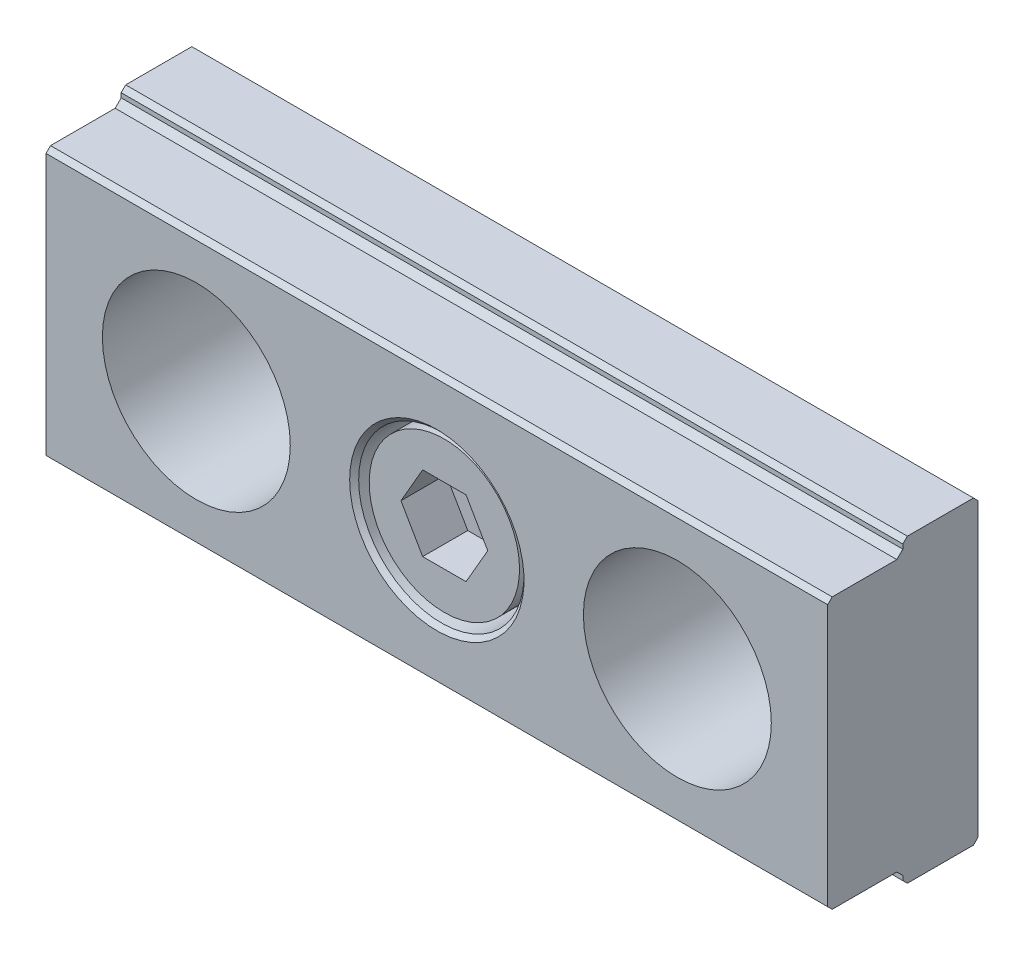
ISO-10303-21;
HEADER;
FILE_DESCRIPTION(('STEP AP214'),'2;1');
FILE_NAME('part.step','',(''),(''),'','','');
FILE_SCHEMA(('AUTOMOTIVE_DESIGN { 1 0 10303 214 1 1 1 1 }'));
ENDSEC;
DATA;
#1=APPLICATION_CONTEXT('core data for automotive mechanical design processes');
#2=APPLICATION_PROTOCOL_DEFINITION('international standard','automotive_design',2000,#1);
#3=PRODUCT_CONTEXT('',#1,'mechanical');
#4=PRODUCT('Part','Part','',(#3));
#5=PRODUCT_RELATED_PRODUCT_CATEGORY('part','',(#4));
#6=PRODUCT_DEFINITION_FORMATION('','',#4);
#7=PRODUCT_DEFINITION_CONTEXT('part definition',#1,'design');
#8=PRODUCT_DEFINITION('design','',#6,#7);
#9=PRODUCT_DEFINITION_SHAPE('','',#8);
#10=(LENGTH_UNIT() NAMED_UNIT(*) SI_UNIT(.MILLI.,.METRE.));
#11=(NAMED_UNIT(*) PLANE_ANGLE_UNIT() SI_UNIT($,.RADIAN.));
#12=(NAMED_UNIT(*) SI_UNIT($,.STERADIAN.) SOLID_ANGLE_UNIT());
#13=UNCERTAINTY_MEASURE_WITH_UNIT(LENGTH_MEASURE(1.E-05),#10,'distance_accuracy_value','');
#14=(GEOMETRIC_REPRESENTATION_CONTEXT(3) GLOBAL_UNCERTAINTY_ASSIGNED_CONTEXT((#13)) GLOBAL_UNIT_ASSIGNED_CONTEXT((#10,
#11,#12)) REPRESENTATION_CONTEXT('',''));
#15=CARTESIAN_POINT('',(0.,0.,0.));
#16=DIRECTION('',(0.,0.,1.));
#17=DIRECTION('',(1.,0.,0.));
#18=AXIS2_PLACEMENT_3D('',#15,#16,#17);
#19=CARTESIAN_POINT('',(0.,-5.5,3.5));
#20=DIRECTION('',(0.,0.,-1.));
#21=DIRECTION('',(1.,0.,0.));
#22=AXIS2_PLACEMENT_3D('',#19,#20,#21);
#23=PLANE('',#22);
#24=CARTESIAN_POINT('',(0.,0.,3.5));
#25=DIRECTION('',(0.,0.,1.));
#26=DIRECTION('',(-1.,0.,0.));
#27=AXIS2_PLACEMENT_3D('',#24,#25,#26);
#28=CIRCLE('',#27,5.5);
#29=CARTESIAN_POINT('',(-5.5,0.,3.5));
#30=VERTEX_POINT('',#29);
#31=EDGE_CURVE('E212',#30,#30,#28,.T.);
#32=ORIENTED_EDGE('',*,*,#31,.T.);
#33=EDGE_LOOP('',(#32));
#34=FACE_BOUND('',#33,.T.);
#35=CARTESIAN_POINT('',(0.,0.,3.5));
#36=DIRECTION('',(0.,0.,1.));
#37=DIRECTION('',(0.,-1.,0.));
#38=AXIS2_PLACEMENT_3D('',#35,#36,#37);
#39=CIRCLE('',#38,5.);
#40=CARTESIAN_POINT('',(0.,-5.,3.5));
#41=VERTEX_POINT('',#40);
#42=EDGE_CURVE('E9',#41,#41,#39,.T.);
#43=ORIENTED_EDGE('',*,*,#42,.F.);
#44=EDGE_LOOP('',(#43));
#45=FACE_BOUND('',#44,.T.);
#46=ADVANCED_FACE('F14',(#34,#45),#23,.F.);
#47=CARTESIAN_POINT('',(-26.,-8.7,10.));
#48=DIRECTION('',(0.,0.707106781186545,-0.70710678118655));
#49=DIRECTION('',(0.,-0.70710678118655,-0.707106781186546));
#50=AXIS2_PLACEMENT_3D('',#47,#48,#49);
#51=PLANE('',#50);
#52=DIRECTION('',(0.,0.70710678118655,0.707106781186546));
#53=VECTOR('',#52,1.);
#54=CARTESIAN_POINT('',(26.,-8.7,10.));
#55=LINE('',#54,#53);
#56=CARTESIAN_POINT('',(26.,-9.,9.7));
#57=VERTEX_POINT('',#56);
#58=CARTESIAN_POINT('',(26.,-8.7,10.));
#59=VERTEX_POINT('',#58);
#60=EDGE_CURVE('E224',#57,#59,#55,.T.);
#61=ORIENTED_EDGE('',*,*,#60,.T.);
#62=DIRECTION('',(1.,0.,0.));
#63=VECTOR('',#62,1.);
#64=CARTESIAN_POINT('',(-26.,-8.7,10.));
#65=LINE('',#64,#63);
#66=CARTESIAN_POINT('',(-26.,-8.7,10.));
#67=VERTEX_POINT('',#66);
#68=EDGE_CURVE('E24',#67,#59,#65,.T.);
#69=ORIENTED_EDGE('',*,*,#68,.F.);
#70=DIRECTION('',(0.,0.70710678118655,0.707106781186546));
#71=VECTOR('',#70,1.);
#72=CARTESIAN_POINT('',(-26.,-8.7,10.));
#73=LINE('',#72,#71);
#74=CARTESIAN_POINT('',(-26.,-9.,9.7));
#75=VERTEX_POINT('',#74);
#76=EDGE_CURVE('E225',#75,#67,#73,.T.);
#77=ORIENTED_EDGE('',*,*,#76,.F.);
#78=DIRECTION('',(1.,0.,0.));
#79=VECTOR('',#78,1.);
#80=CARTESIAN_POINT('',(-26.,-9.,9.7));
#81=LINE('',#80,#79);
#82=EDGE_CURVE('E270',#75,#57,#81,.T.);
#83=ORIENTED_EDGE('',*,*,#82,.T.);
#84=EDGE_LOOP('',(#61,#69,#77,#83));
#85=FACE_BOUND('',#84,.T.);
#86=ADVANCED_FACE('F356',(#85),#51,.F.);
#87=CARTESIAN_POINT('',(-26.,8.7,10.));
#88=DIRECTION('',(0.,0.,-1.));
#89=DIRECTION('',(1.,0.,0.));
#90=AXIS2_PLACEMENT_3D('',#87,#88,#89);
#91=PLANE('',#90);
#92=CARTESIAN_POINT('',(-16.,0.,10.));
#93=DIRECTION('',(0.,0.,1.));
#94=DIRECTION('',(-1.,0.,0.));
#95=AXIS2_PLACEMENT_3D('',#92,#93,#94);
#96=CIRCLE('',#95,6.25);
#97=CARTESIAN_POINT('',(-22.25,0.,10.));
#98=VERTEX_POINT('',#97);
#99=EDGE_CURVE('E189',#98,#98,#96,.T.);
#100=ORIENTED_EDGE('',*,*,#99,.F.);
#101=EDGE_LOOP('',(#100));
#102=FACE_BOUND('',#101,.T.);
#103=CARTESIAN_POINT('',(16.,0.,10.));
#104=DIRECTION('',(0.,0.,1.));
#105=DIRECTION('',(-1.,0.,0.));
#106=AXIS2_PLACEMENT_3D('',#103,#104,#105);
#107=CIRCLE('',#106,6.25);
#108=CARTESIAN_POINT('',(9.75,0.,10.));
#109=VERTEX_POINT('',#108);
#110=EDGE_CURVE('E198',#109,#109,#107,.T.);
#111=ORIENTED_EDGE('',*,*,#110,.F.);
#112=EDGE_LOOP('',(#111));
#113=FACE_BOUND('',#112,.T.);
#114=CARTESIAN_POINT('',(0.,0.,10.));
#115=DIRECTION('',(0.,0.,1.));
#116=DIRECTION('',(-1.,0.,0.));
#117=AXIS2_PLACEMENT_3D('',#114,#115,#116);
#118=CIRCLE('',#117,5.8);
#119=CARTESIAN_POINT('',(-5.8,0.,10.));
#120=VERTEX_POINT('',#119);
#121=EDGE_CURVE('E204',#120,#120,#118,.T.);
#122=ORIENTED_EDGE('',*,*,#121,.F.);
#123=EDGE_LOOP('',(#122));
#124=FACE_BOUND('',#123,.T.);
#125=DIRECTION('',(0.,1.,0.));
#126=VECTOR('',#125,1.);
#127=CARTESIAN_POINT('',(26.,8.7,10.));
#128=LINE('',#127,#126);
#129=CARTESIAN_POINT('',(26.,8.7,10.));
#130=VERTEX_POINT('',#129);
#131=EDGE_CURVE('E273',#59,#130,#128,.T.);
#132=ORIENTED_EDGE('',*,*,#131,.T.);
#133=DIRECTION('',(1.,0.,0.));
#134=VECTOR('',#133,1.);
#135=CARTESIAN_POINT('',(-26.,8.7,10.));
#136=LINE('',#135,#134);
#137=CARTESIAN_POINT('',(-26.,8.7,10.));
#138=VERTEX_POINT('',#137);
#139=EDGE_CURVE('E342',#138,#130,#136,.T.);
#140=ORIENTED_EDGE('',*,*,#139,.F.);
#141=DIRECTION('',(0.,1.,0.));
#142=VECTOR('',#141,1.);
#143=CARTESIAN_POINT('',(-26.,8.7,10.));
#144=LINE('',#143,#142);
#145=EDGE_CURVE('E227',#67,#138,#144,.T.);
#146=ORIENTED_EDGE('',*,*,#145,.F.);
#147=ORIENTED_EDGE('',*,*,#68,.T.);
#148=EDGE_LOOP('',(#132,#140,#146,#147));
#149=FACE_BOUND('',#148,.T.);
#150=ADVANCED_FACE('F352',(#102,#113,#124,#149),#91,.F.);
#151=CARTESIAN_POINT('',(-26.,9.,9.7));
#152=DIRECTION('',(0.,-0.707106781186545,-0.70710678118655));
#153=DIRECTION('',(0.,-0.70710678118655,0.707106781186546));
#154=AXIS2_PLACEMENT_3D('',#151,#152,#153);
#155=PLANE('',#154);
#156=DIRECTION('',(0.,0.70710678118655,-0.707106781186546));
#157=VECTOR('',#156,1.);
#158=CARTESIAN_POINT('',(26.,9.,9.7));
#159=LINE('',#158,#157);
#160=CARTESIAN_POINT('',(26.,9.,9.7));
#161=VERTEX_POINT('',#160);
#162=EDGE_CURVE('E275',#130,#161,#159,.T.);
#163=ORIENTED_EDGE('',*,*,#162,.T.);
#164=DIRECTION('',(1.,0.,0.));
#165=VECTOR('',#164,1.);
#166=CARTESIAN_POINT('',(-26.,9.,9.7));
#167=LINE('',#166,#165);
#168=CARTESIAN_POINT('',(-26.,9.,9.7));
#169=VERTEX_POINT('',#168);
#170=EDGE_CURVE('E340',#169,#161,#167,.T.);
#171=ORIENTED_EDGE('',*,*,#170,.F.);
#172=DIRECTION('',(0.,0.70710678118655,-0.707106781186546));
#173=VECTOR('',#172,1.);
#174=CARTESIAN_POINT('',(-26.,9.,9.7));
#175=LINE('',#174,#173);
#176=EDGE_CURVE('E231',#138,#169,#175,.T.);
#177=ORIENTED_EDGE('',*,*,#176,.F.);
#178=ORIENTED_EDGE('',*,*,#139,.T.);
#179=EDGE_LOOP('',(#163,#171,#177,#178));
#180=FACE_BOUND('',#179,.T.);
#181=ADVANCED_FACE('F364',(#180),#155,.F.);
#182=CARTESIAN_POINT('',(-26.,9.,5.4));
#183=DIRECTION('',(0.,-1.,0.));
#184=DIRECTION('',(1.,0.,0.));
#185=AXIS2_PLACEMENT_3D('',#182,#183,#184);
#186=PLANE('',#185);
#187=DIRECTION('',(0.,0.,-1.));
#188=VECTOR('',#187,1.);
#189=CARTESIAN_POINT('',(26.,9.,5.4));
#190=LINE('',#189,#188);
#191=CARTESIAN_POINT('',(26.,9.,5.4));
#192=VERTEX_POINT('',#191);
#193=EDGE_CURVE('E277',#161,#192,#190,.T.);
#194=ORIENTED_EDGE('',*,*,#193,.T.);
#195=DIRECTION('',(1.,0.,0.));
#196=VECTOR('',#195,1.);
#197=CARTESIAN_POINT('',(-26.,9.,5.4));
#198=LINE('',#197,#196);
#199=CARTESIAN_POINT('',(-26.,9.,5.4));
#200=VERTEX_POINT('',#199);
#201=EDGE_CURVE('E337',#200,#192,#198,.T.);
#202=ORIENTED_EDGE('',*,*,#201,.F.);
#203=DIRECTION('',(0.,0.,-1.));
#204=VECTOR('',#203,1.);
#205=CARTESIAN_POINT('',(-26.,9.,5.4));
#206=LINE('',#205,#204);
#207=EDGE_CURVE('E234',#169,#200,#206,.T.);
#208=ORIENTED_EDGE('',*,*,#207,.F.);
#209=ORIENTED_EDGE('',*,*,#170,.T.);
#210=EDGE_LOOP('',(#194,#202,#208,#209));
#211=FACE_BOUND('',#210,.T.);
#212=ADVANCED_FACE('F368',(#211),#186,.F.);
#213=CARTESIAN_POINT('',(-26.,9.4,5.));
#214=DIRECTION('',(0.,-0.707106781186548,-0.707106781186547));
#215=DIRECTION('',(0.,-0.707106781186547,0.707106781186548));
#216=AXIS2_PLACEMENT_3D('',#213,#214,#215);
#217=PLANE('',#216);
#218=DIRECTION('',(0.,0.707106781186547,-0.707106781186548));
#219=VECTOR('',#218,1.);
#220=CARTESIAN_POINT('',(26.,9.4,5.));
#221=LINE('',#220,#219);
#222=CARTESIAN_POINT('',(26.,9.4,5.));
#223=VERTEX_POINT('',#222);
#224=EDGE_CURVE('E279',#192,#223,#221,.T.);
#225=ORIENTED_EDGE('',*,*,#224,.T.);
#226=DIRECTION('',(1.,0.,0.));
#227=VECTOR('',#226,1.);
#228=CARTESIAN_POINT('',(-26.,9.4,5.));
#229=LINE('',#228,#227);
#230=CARTESIAN_POINT('',(-26.,9.4,5.));
#231=VERTEX_POINT('',#230);
#232=EDGE_CURVE('E334',#231,#223,#229,.T.);
#233=ORIENTED_EDGE('',*,*,#232,.F.);
#234=DIRECTION('',(0.,0.707106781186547,-0.707106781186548));
#235=VECTOR('',#234,1.);
#236=CARTESIAN_POINT('',(-26.,9.4,5.));
#237=LINE('',#236,#235);
#238=EDGE_CURVE('E237',#200,#231,#237,.T.);
#239=ORIENTED_EDGE('',*,*,#238,.F.);
#240=ORIENTED_EDGE('',*,*,#201,.T.);
#241=EDGE_LOOP('',(#225,#233,#239,#240));
#242=FACE_BOUND('',#241,.T.);
#243=ADVANCED_FACE('F683',(#242),#217,.F.);
#244=CARTESIAN_POINT('',(-26.,9.7,5.));
#245=DIRECTION('',(0.,0.,-1.));
#246=DIRECTION('',(1.,0.,0.));
#247=AXIS2_PLACEMENT_3D('',#244,#245,#246);
#248=PLANE('',#247);
#249=DIRECTION('',(0.,1.,0.));
#250=VECTOR('',#249,1.);
#251=CARTESIAN_POINT('',(26.,9.7,5.));
#252=LINE('',#251,#250);
#253=CARTESIAN_POINT('',(26.,9.7,5.));
#254=VERTEX_POINT('',#253);
#255=EDGE_CURVE('E281',#223,#254,#252,.T.);
#256=ORIENTED_EDGE('',*,*,#255,.T.);
#257=DIRECTION('',(1.,0.,0.));
#258=VECTOR('',#257,1.);
#259=CARTESIAN_POINT('',(-26.,9.7,5.));
#260=LINE('',#259,#258);
#261=CARTESIAN_POINT('',(-26.,9.7,5.));
#262=VERTEX_POINT('',#261);
#263=EDGE_CURVE('E331',#262,#254,#260,.T.);
#264=ORIENTED_EDGE('',*,*,#263,.F.);
#265=DIRECTION('',(0.,1.,0.));
#266=VECTOR('',#265,1.);
#267=CARTESIAN_POINT('',(-26.,9.7,5.));
#268=LINE('',#267,#266);
#269=EDGE_CURVE('E240',#231,#262,#268,.T.);
#270=ORIENTED_EDGE('',*,*,#269,.F.);
#271=ORIENTED_EDGE('',*,*,#232,.T.);
#272=EDGE_LOOP('',(#256,#264,#270,#271));
#273=FACE_BOUND('',#272,.T.);
#274=ADVANCED_FACE('F674',(#273),#248,.F.);
#275=CARTESIAN_POINT('',(-26.,10.,4.7));
#276=DIRECTION('',(0.,-0.707106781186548,-0.707106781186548));
#277=DIRECTION('',(0.,-0.707106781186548,0.707106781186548));
#278=AXIS2_PLACEMENT_3D('',#275,#276,#277);
#279=PLANE('',#278);
#280=DIRECTION('',(0.,0.707106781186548,-0.707106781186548));
#281=VECTOR('',#280,1.);
#282=CARTESIAN_POINT('',(26.,10.,4.7));
#283=LINE('',#282,#281);
#284=CARTESIAN_POINT('',(26.,10.,4.7));
#285=VERTEX_POINT('',#284);
#286=EDGE_CURVE('E283',#254,#285,#283,.T.);
#287=ORIENTED_EDGE('',*,*,#286,.T.);
#288=DIRECTION('',(1.,0.,0.));
#289=VECTOR('',#288,1.);
#290=CARTESIAN_POINT('',(-26.,10.,4.7));
#291=LINE('',#290,#289);
#292=CARTESIAN_POINT('',(-26.,10.,4.7));
#293=VERTEX_POINT('',#292);
#294=EDGE_CURVE('E328',#293,#285,#291,.T.);
#295=ORIENTED_EDGE('',*,*,#294,.F.);
#296=DIRECTION('',(0.,0.707106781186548,-0.707106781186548));
#297=VECTOR('',#296,1.);
#298=CARTESIAN_POINT('',(-26.,10.,4.7));
#299=LINE('',#298,#297);
#300=EDGE_CURVE('E243',#262,#293,#299,.T.);
#301=ORIENTED_EDGE('',*,*,#300,.F.);
#302=ORIENTED_EDGE('',*,*,#263,.T.);
#303=EDGE_LOOP('',(#287,#295,#301,#302));
#304=FACE_BOUND('',#303,.T.);
#305=ADVANCED_FACE('F665',(#304),#279,.F.);
#306=CARTESIAN_POINT('',(-26.,10.,0.3));
#307=DIRECTION('',(0.,-1.,0.));
#308=DIRECTION('',(0.,0.,1.));
#309=AXIS2_PLACEMENT_3D('',#306,#307,#308);
#310=PLANE('',#309);
#311=DIRECTION('',(0.,0.,-1.));
#312=VECTOR('',#311,1.);
#313=CARTESIAN_POINT('',(26.,10.,0.3));
#314=LINE('',#313,#312);
#315=CARTESIAN_POINT('',(26.,10.,0.3));
#316=VERTEX_POINT('',#315);
#317=EDGE_CURVE('E285',#285,#316,#314,.T.);
#318=ORIENTED_EDGE('',*,*,#317,.T.);
#319=DIRECTION('',(1.,0.,0.));
#320=VECTOR('',#319,1.);
#321=CARTESIAN_POINT('',(-26.,10.,0.3));
#322=LINE('',#321,#320);
#323=CARTESIAN_POINT('',(-26.,10.,0.3));
#324=VERTEX_POINT('',#323);
#325=EDGE_CURVE('E325',#324,#316,#322,.T.);
#326=ORIENTED_EDGE('',*,*,#325,.F.);
#327=DIRECTION('',(0.,0.,-1.));
#328=VECTOR('',#327,1.);
#329=CARTESIAN_POINT('',(-26.,10.,0.3));
#330=LINE('',#329,#328);
#331=EDGE_CURVE('E246',#293,#324,#330,.T.);
#332=ORIENTED_EDGE('',*,*,#331,.F.);
#333=ORIENTED_EDGE('',*,*,#294,.T.);
#334=EDGE_LOOP('',(#318,#326,#332,#333));
#335=FACE_BOUND('',#334,.T.);
#336=ADVANCED_FACE('F656',(#335),#310,.F.);
#337=CARTESIAN_POINT('',(-26.,10.,0.3));
#338=DIRECTION('',(0.,-0.70710678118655,0.707106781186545));
#339=DIRECTION('',(0.,0.707106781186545,0.70710678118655));
#340=AXIS2_PLACEMENT_3D('',#337,#338,#339);
#341=PLANE('',#340);
#342=DIRECTION('',(0.,-0.707106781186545,-0.70710678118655));
#343=VECTOR('',#342,1.);
#344=CARTESIAN_POINT('',(26.,10.,0.3));
#345=LINE('',#344,#343);
#346=CARTESIAN_POINT('',(26.,9.7,0.));
#347=VERTEX_POINT('',#346);
#348=EDGE_CURVE('E287',#316,#347,#345,.T.);
#349=ORIENTED_EDGE('',*,*,#348,.T.);
#350=DIRECTION('',(1.,0.,0.));
#351=VECTOR('',#350,1.);
#352=CARTESIAN_POINT('',(-26.,9.7,0.));
#353=LINE('',#352,#351);
#354=CARTESIAN_POINT('',(-26.,9.7,0.));
#355=VERTEX_POINT('',#354);
#356=EDGE_CURVE('E322',#355,#347,#353,.T.);
#357=ORIENTED_EDGE('',*,*,#356,.F.);
#358=DIRECTION('',(0.,-0.707106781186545,-0.70710678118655));
#359=VECTOR('',#358,1.);
#360=CARTESIAN_POINT('',(-26.,10.,0.3));
#361=LINE('',#360,#359);
#362=EDGE_CURVE('E249',#324,#355,#361,.T.);
#363=ORIENTED_EDGE('',*,*,#362,.F.);
#364=ORIENTED_EDGE('',*,*,#325,.T.);
#365=EDGE_LOOP('',(#349,#357,#363,#364));
#366=FACE_BOUND('',#365,.T.);
#367=ADVANCED_FACE('F647',(#366),#341,.F.);
#368=CARTESIAN_POINT('',(-26.,9.7,0.));
#369=DIRECTION('',(0.,0.,1.));
#370=DIRECTION('',(-1.,0.,0.));
#371=AXIS2_PLACEMENT_3D('',#368,#369,#370);
#372=PLANE('',#371);
#373=CARTESIAN_POINT('',(-16.,0.,0.));
#374=DIRECTION('',(0.,0.,1.));
#375=DIRECTION('',(-1.,0.,0.));
#376=AXIS2_PLACEMENT_3D('',#373,#374,#375);
#377=CIRCLE('',#376,6.25);
#378=CARTESIAN_POINT('',(-22.25,0.,0.));
#379=VERTEX_POINT('',#378);
#380=EDGE_CURVE('E193',#379,#379,#377,.T.);
#381=ORIENTED_EDGE('',*,*,#380,.T.);
#382=EDGE_LOOP('',(#381));
#383=FACE_BOUND('',#382,.T.);
#384=CARTESIAN_POINT('',(16.,0.,0.));
#385=DIRECTION('',(0.,0.,1.));
#386=DIRECTION('',(-1.,0.,0.));
#387=AXIS2_PLACEMENT_3D('',#384,#385,#386);
#388=CIRCLE('',#387,6.25);
#389=CARTESIAN_POINT('',(9.75,0.,0.));
#390=VERTEX_POINT('',#389);
#391=EDGE_CURVE('E201',#390,#390,#388,.T.);
#392=ORIENTED_EDGE('',*,*,#391,.T.);
#393=EDGE_LOOP('',(#392));
#394=FACE_BOUND('',#393,.T.);
#395=CARTESIAN_POINT('',(0.,0.,0.));
#396=DIRECTION('',(0.,0.,1.));
#397=DIRECTION('',(-1.,0.,0.));
#398=AXIS2_PLACEMENT_3D('',#395,#396,#397);
#399=CIRCLE('',#398,3.6);
#400=CARTESIAN_POINT('',(-3.6,0.,0.));
#401=VERTEX_POINT('',#400);
#402=EDGE_CURVE('E221',#401,#401,#399,.T.);
#403=ORIENTED_EDGE('',*,*,#402,.T.);
#404=EDGE_LOOP('',(#403));
#405=FACE_BOUND('',#404,.T.);
#406=DIRECTION('',(0.,-1.,0.));
#407=VECTOR('',#406,1.);
#408=CARTESIAN_POINT('',(26.,9.7,0.));
#409=LINE('',#408,#407);
#410=CARTESIAN_POINT('',(26.,-9.7,0.));
#411=VERTEX_POINT('',#410);
#412=EDGE_CURVE('E289',#347,#411,#409,.T.);
#413=ORIENTED_EDGE('',*,*,#412,.T.);
#414=DIRECTION('',(1.,0.,0.));
#415=VECTOR('',#414,1.);
#416=CARTESIAN_POINT('',(-26.,-9.7,0.));
#417=LINE('',#416,#415);
#418=CARTESIAN_POINT('',(-26.,-9.7,0.));
#419=VERTEX_POINT('',#418);
#420=EDGE_CURVE('E319',#419,#411,#417,.T.);
#421=ORIENTED_EDGE('',*,*,#420,.F.);
#422=DIRECTION('',(0.,-1.,0.));
#423=VECTOR('',#422,1.);
#424=CARTESIAN_POINT('',(-26.,9.7,0.));
#425=LINE('',#424,#423);
#426=EDGE_CURVE('E252',#355,#419,#425,.T.);
#427=ORIENTED_EDGE('',*,*,#426,.F.);
#428=ORIENTED_EDGE('',*,*,#356,.T.);
#429=EDGE_LOOP('',(#413,#421,#427,#428));
#430=FACE_BOUND('',#429,.T.);
#431=ADVANCED_FACE('F638',(#383,#394,#405,#430),#372,.F.);
#432=CARTESIAN_POINT('',(-26.,-9.7,0.));
#433=DIRECTION('',(0.,0.70710678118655,0.707106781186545));
#434=DIRECTION('',(0.,0.707106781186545,-0.70710678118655));
#435=AXIS2_PLACEMENT_3D('',#432,#433,#434);
#436=PLANE('',#435);
#437=DIRECTION('',(0.,-0.707106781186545,0.70710678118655));
#438=VECTOR('',#437,1.);
#439=CARTESIAN_POINT('',(26.,-9.7,0.));
#440=LINE('',#439,#438);
#441=CARTESIAN_POINT('',(26.,-10.,0.3));
#442=VERTEX_POINT('',#441);
#443=EDGE_CURVE('E291',#411,#442,#440,.T.);
#444=ORIENTED_EDGE('',*,*,#443,.T.);
#445=DIRECTION('',(1.,0.,0.));
#446=VECTOR('',#445,1.);
#447=CARTESIAN_POINT('',(-26.,-10.,0.3));
#448=LINE('',#447,#446);
#449=CARTESIAN_POINT('',(-26.,-10.,0.3));
#450=VERTEX_POINT('',#449);
#451=EDGE_CURVE('E316',#450,#442,#448,.T.);
#452=ORIENTED_EDGE('',*,*,#451,.F.);
#453=DIRECTION('',(0.,-0.707106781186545,0.70710678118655));
#454=VECTOR('',#453,1.);
#455=CARTESIAN_POINT('',(-26.,-9.7,0.));
#456=LINE('',#455,#454);
#457=EDGE_CURVE('E255',#419,#450,#456,.T.);
#458=ORIENTED_EDGE('',*,*,#457,.F.);
#459=ORIENTED_EDGE('',*,*,#420,.T.);
#460=EDGE_LOOP('',(#444,#452,#458,#459));
#461=FACE_BOUND('',#460,.T.);
#462=ADVANCED_FACE('F629',(#461),#436,.F.);
#463=CARTESIAN_POINT('',(-26.,-10.,0.3));
#464=DIRECTION('',(0.,1.,0.));
#465=DIRECTION('',(0.,0.,-1.));
#466=AXIS2_PLACEMENT_3D('',#463,#464,#465);
#467=PLANE('',#466);
#468=DIRECTION('',(0.,0.,1.));
#469=VECTOR('',#468,1.);
#470=CARTESIAN_POINT('',(26.,-10.,0.3));
#471=LINE('',#470,#469);
#472=CARTESIAN_POINT('',(26.,-10.,4.7));
#473=VERTEX_POINT('',#472);
#474=EDGE_CURVE('E293',#442,#473,#471,.T.);
#475=ORIENTED_EDGE('',*,*,#474,.T.);
#476=DIRECTION('',(1.,0.,0.));
#477=VECTOR('',#476,1.);
#478=CARTESIAN_POINT('',(-26.,-10.,4.7));
#479=LINE('',#478,#477);
#480=CARTESIAN_POINT('',(-26.,-10.,4.7));
#481=VERTEX_POINT('',#480);
#482=EDGE_CURVE('E313',#481,#473,#479,.T.);
#483=ORIENTED_EDGE('',*,*,#482,.F.);
#484=DIRECTION('',(0.,0.,1.));
#485=VECTOR('',#484,1.);
#486=CARTESIAN_POINT('',(-26.,-10.,0.3));
#487=LINE('',#486,#485);
#488=EDGE_CURVE('E258',#450,#481,#487,.T.);
#489=ORIENTED_EDGE('',*,*,#488,.F.);
#490=ORIENTED_EDGE('',*,*,#451,.T.);
#491=EDGE_LOOP('',(#475,#483,#489,#490));
#492=FACE_BOUND('',#491,.T.);
#493=ADVANCED_FACE('F620',(#492),#467,.F.);
#494=CARTESIAN_POINT('',(-26.,-9.7,5.));
#495=DIRECTION('',(0.,0.707106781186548,-0.707106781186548));
#496=DIRECTION('',(0.,-0.707106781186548,-0.707106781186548));
#497=AXIS2_PLACEMENT_3D('',#494,#495,#496);
#498=PLANE('',#497);
#499=DIRECTION('',(0.,0.707106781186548,0.707106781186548));
#500=VECTOR('',#499,1.);
#501=CARTESIAN_POINT('',(26.,-9.7,5.));
#502=LINE('',#501,#500);
#503=CARTESIAN_POINT('',(26.,-9.7,5.));
#504=VERTEX_POINT('',#503);
#505=EDGE_CURVE('E295',#473,#504,#502,.T.);
#506=ORIENTED_EDGE('',*,*,#505,.T.);
#507=DIRECTION('',(1.,0.,0.));
#508=VECTOR('',#507,1.);
#509=CARTESIAN_POINT('',(-26.,-9.7,5.));
#510=LINE('',#509,#508);
#511=CARTESIAN_POINT('',(-26.,-9.7,5.));
#512=VERTEX_POINT('',#511);
#513=EDGE_CURVE('E310',#512,#504,#510,.T.);
#514=ORIENTED_EDGE('',*,*,#513,.F.);
#515=DIRECTION('',(0.,0.707106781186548,0.707106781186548));
#516=VECTOR('',#515,1.);
#517=CARTESIAN_POINT('',(-26.,-9.7,5.));
#518=LINE('',#517,#516);
#519=EDGE_CURVE('E261',#481,#512,#518,.T.);
#520=ORIENTED_EDGE('',*,*,#519,.F.);
#521=ORIENTED_EDGE('',*,*,#482,.T.);
#522=EDGE_LOOP('',(#506,#514,#520,#521));
#523=FACE_BOUND('',#522,.T.);
#524=ADVANCED_FACE('F613',(#523),#498,.F.);
#525=CARTESIAN_POINT('',(-26.,-9.4,5.));
#526=DIRECTION('',(0.,0.,-1.));
#527=DIRECTION('',(1.,0.,0.));
#528=AXIS2_PLACEMENT_3D('',#525,#526,#527);
#529=PLANE('',#528);
#530=DIRECTION('',(0.,1.,0.));
#531=VECTOR('',#530,1.);
#532=CARTESIAN_POINT('',(26.,-9.4,5.));
#533=LINE('',#532,#531);
#534=CARTESIAN_POINT('',(26.,-9.4,5.));
#535=VERTEX_POINT('',#534);
#536=EDGE_CURVE('E297',#504,#535,#533,.T.);
#537=ORIENTED_EDGE('',*,*,#536,.T.);
#538=DIRECTION('',(1.,0.,0.));
#539=VECTOR('',#538,1.);
#540=CARTESIAN_POINT('',(-26.,-9.4,5.));
#541=LINE('',#540,#539);
#542=CARTESIAN_POINT('',(-26.,-9.4,5.));
#543=VERTEX_POINT('',#542);
#544=EDGE_CURVE('E307',#543,#535,#541,.T.);
#545=ORIENTED_EDGE('',*,*,#544,.F.);
#546=DIRECTION('',(0.,1.,0.));
#547=VECTOR('',#546,1.);
#548=CARTESIAN_POINT('',(-26.,-9.4,5.));
#549=LINE('',#548,#547);
#550=EDGE_CURVE('E264',#512,#543,#549,.T.);
#551=ORIENTED_EDGE('',*,*,#550,.F.);
#552=ORIENTED_EDGE('',*,*,#513,.T.);
#553=EDGE_LOOP('',(#537,#545,#551,#552));
#554=FACE_BOUND('',#553,.T.);
#555=ADVANCED_FACE('F403',(#554),#529,.F.);
#556=CARTESIAN_POINT('',(-26.,-9.4,5.));
#557=DIRECTION('',(0.,0.707106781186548,-0.707106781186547));
#558=DIRECTION('',(0.,-0.707106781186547,-0.707106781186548));
#559=AXIS2_PLACEMENT_3D('',#556,#557,#558);
#560=PLANE('',#559);
#561=DIRECTION('',(0.,0.707106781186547,0.707106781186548));
#562=VECTOR('',#561,1.);
#563=CARTESIAN_POINT('',(26.,-9.4,5.));
#564=LINE('',#563,#562);
#565=CARTESIAN_POINT('',(26.,-9.,5.4));
#566=VERTEX_POINT('',#565);
#567=EDGE_CURVE('E299',#535,#566,#564,.T.);
#568=ORIENTED_EDGE('',*,*,#567,.T.);
#569=DIRECTION('',(1.,0.,0.));
#570=VECTOR('',#569,1.);
#571=CARTESIAN_POINT('',(-26.,-9.,5.4));
#572=LINE('',#571,#570);
#573=CARTESIAN_POINT('',(-26.,-9.,5.4));
#574=VERTEX_POINT('',#573);
#575=EDGE_CURVE('E304',#574,#566,#572,.T.);
#576=ORIENTED_EDGE('',*,*,#575,.F.);
#577=DIRECTION('',(0.,0.707106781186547,0.707106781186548));
#578=VECTOR('',#577,1.);
#579=CARTESIAN_POINT('',(-26.,-9.4,5.));
#580=LINE('',#579,#578);
#581=EDGE_CURVE('E267',#543,#574,#580,.T.);
#582=ORIENTED_EDGE('',*,*,#581,.F.);
#583=ORIENTED_EDGE('',*,*,#544,.T.);
#584=EDGE_LOOP('',(#568,#576,#582,#583));
#585=FACE_BOUND('',#584,.T.);
#586=ADVANCED_FACE('F406',(#585),#560,.F.);
#587=CARTESIAN_POINT('',(-26.,-9.,5.4));
#588=DIRECTION('',(0.,1.,0.));
#589=DIRECTION('',(-1.,0.,0.));
#590=AXIS2_PLACEMENT_3D('',#587,#588,#589);
#591=PLANE('',#590);
#592=DIRECTION('',(0.,0.,1.));
#593=VECTOR('',#592,1.);
#594=CARTESIAN_POINT('',(26.,-9.,5.4));
#595=LINE('',#594,#593);
#596=EDGE_CURVE('E228',#566,#57,#595,.T.);
#597=ORIENTED_EDGE('',*,*,#596,.T.);
#598=ORIENTED_EDGE('',*,*,#82,.F.);
#599=DIRECTION('',(0.,0.,1.));
#600=VECTOR('',#599,1.);
#601=CARTESIAN_POINT('',(-26.,-9.,5.4));
#602=LINE('',#601,#600);
#603=EDGE_CURVE('E32',#574,#75,#602,.T.);
#604=ORIENTED_EDGE('',*,*,#603,.F.);
#605=ORIENTED_EDGE('',*,*,#575,.T.);
#606=EDGE_LOOP('',(#597,#598,#604,#605));
#607=FACE_BOUND('',#606,.T.);
#608=ADVANCED_FACE('F408',(#607),#591,.F.);
#609=CARTESIAN_POINT('',(-26.,-14.2,4.5));
#610=DIRECTION('',(-1.,0.,0.));
#611=DIRECTION('',(0.,-1.,0.));
#612=AXIS2_PLACEMENT_3D('',#609,#610,#611);
#613=PLANE('',#612);
#614=ORIENTED_EDGE('',*,*,#76,.T.);
#615=ORIENTED_EDGE('',*,*,#145,.T.);
#616=ORIENTED_EDGE('',*,*,#176,.T.);
#617=ORIENTED_EDGE('',*,*,#207,.T.);
#618=ORIENTED_EDGE('',*,*,#238,.T.);
#619=ORIENTED_EDGE('',*,*,#269,.T.);
#620=ORIENTED_EDGE('',*,*,#300,.T.);
#621=ORIENTED_EDGE('',*,*,#331,.T.);
#622=ORIENTED_EDGE('',*,*,#362,.T.);
#623=ORIENTED_EDGE('',*,*,#426,.T.);
#624=ORIENTED_EDGE('',*,*,#457,.T.);
#625=ORIENTED_EDGE('',*,*,#488,.T.);
#626=ORIENTED_EDGE('',*,*,#519,.T.);
#627=ORIENTED_EDGE('',*,*,#550,.T.);
#628=ORIENTED_EDGE('',*,*,#581,.T.);
#629=ORIENTED_EDGE('',*,*,#603,.T.);
#630=EDGE_LOOP('',(#614,#615,#616,#617,#618,#619,#620,#621,#622,#623,#624,#625,#626,#627,#628,#629));
#631=FACE_BOUND('',#630,.T.);
#632=ADVANCED_FACE('F374',(#631),#613,.T.);
#633=CARTESIAN_POINT('',(26.,-14.2,4.5));
#634=DIRECTION('',(-1.,0.,0.));
#635=DIRECTION('',(0.,-1.,0.));
#636=AXIS2_PLACEMENT_3D('',#633,#634,#635);
#637=PLANE('',#636);
#638=ORIENTED_EDGE('',*,*,#60,.F.);
#639=ORIENTED_EDGE('',*,*,#596,.F.);
#640=ORIENTED_EDGE('',*,*,#567,.F.);
#641=ORIENTED_EDGE('',*,*,#536,.F.);
#642=ORIENTED_EDGE('',*,*,#505,.F.);
#643=ORIENTED_EDGE('',*,*,#474,.F.);
#644=ORIENTED_EDGE('',*,*,#443,.F.);
#645=ORIENTED_EDGE('',*,*,#412,.F.);
#646=ORIENTED_EDGE('',*,*,#348,.F.);
#647=ORIENTED_EDGE('',*,*,#317,.F.);
#648=ORIENTED_EDGE('',*,*,#286,.F.);
#649=ORIENTED_EDGE('',*,*,#255,.F.);
#650=ORIENTED_EDGE('',*,*,#224,.F.);
#651=ORIENTED_EDGE('',*,*,#193,.F.);
#652=ORIENTED_EDGE('',*,*,#162,.F.);
#653=ORIENTED_EDGE('',*,*,#131,.F.);
#654=EDGE_LOOP('',(#638,#639,#640,#641,#642,#643,#644,#645,#646,#647,#648,#649,#650,#651,#652,#653));
#655=FACE_BOUND('',#654,.T.);
#656=ADVANCED_FACE('F359',(#655),#637,.F.);
#657=CARTESIAN_POINT('',(0.,0.,0.3));
#658=DIRECTION('',(0.,0.,-1.));
#659=DIRECTION('',(1.,0.,0.));
#660=AXIS2_PLACEMENT_3D('',#657,#658,#659);
#661=CONICAL_SURFACE('',#660,3.3,0.78539816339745);
#662=ORIENTED_EDGE('',*,*,#402,.F.);
#663=EDGE_LOOP('',(#662));
#664=FACE_BOUND('',#663,.T.);
#665=CARTESIAN_POINT('',(0.,0.,0.3));
#666=DIRECTION('',(0.,0.,1.));
#667=DIRECTION('',(-1.,0.,0.));
#668=AXIS2_PLACEMENT_3D('',#665,#666,#667);
#669=CIRCLE('',#668,3.3);
#670=CARTESIAN_POINT('',(-3.3,0.,0.3));
#671=VERTEX_POINT('',#670);
#672=EDGE_CURVE('E218',#671,#671,#669,.T.);
#673=ORIENTED_EDGE('',*,*,#672,.T.);
#674=EDGE_LOOP('',(#673));
#675=FACE_BOUND('',#674,.T.);
#676=ADVANCED_FACE('F482',(#664,#675),#661,.F.);
#677=CARTESIAN_POINT('',(0.,0.,10.));
#678=DIRECTION('',(0.,0.,1.));
#679=DIRECTION('',(-1.,0.,0.));
#680=AXIS2_PLACEMENT_3D('',#677,#678,#679);
#681=CYLINDRICAL_SURFACE('',#680,3.3);
#682=ORIENTED_EDGE('',*,*,#672,.F.);
#683=EDGE_LOOP('',(#682));
#684=FACE_BOUND('',#683,.T.);
#685=CARTESIAN_POINT('',(0.,0.,3.5));
#686=DIRECTION('',(0.,0.,1.));
#687=DIRECTION('',(-1.,0.,0.));
#688=AXIS2_PLACEMENT_3D('',#685,#686,#687);
#689=CIRCLE('',#688,3.3);
#690=CARTESIAN_POINT('',(-3.3,0.,3.5));
#691=VERTEX_POINT('',#690);
#692=EDGE_CURVE('E215',#691,#691,#689,.T.);
#693=ORIENTED_EDGE('',*,*,#692,.T.);
#694=EDGE_LOOP('',(#693));
#695=FACE_BOUND('',#694,.T.);
#696=ADVANCED_FACE('F479',(#684,#695),#681,.F.);
#697=CARTESIAN_POINT('',(0.,0.,10.));
#698=DIRECTION('',(0.,0.,1.));
#699=DIRECTION('',(-1.,0.,0.));
#700=AXIS2_PLACEMENT_3D('',#697,#698,#699);
#701=CYLINDRICAL_SURFACE('',#700,5.5);
#702=ORIENTED_EDGE('',*,*,#31,.F.);
#703=EDGE_LOOP('',(#702));
#704=FACE_BOUND('',#703,.T.);
#705=CARTESIAN_POINT('',(0.,0.,9.7));
#706=DIRECTION('',(0.,0.,1.));
#707=DIRECTION('',(-1.,0.,0.));
#708=AXIS2_PLACEMENT_3D('',#705,#706,#707);
#709=CIRCLE('',#708,5.5);
#710=CARTESIAN_POINT('',(-5.5,0.,9.7));
#711=VERTEX_POINT('',#710);
#712=EDGE_CURVE('E209',#711,#711,#709,.T.);
#713=ORIENTED_EDGE('',*,*,#712,.T.);
#714=EDGE_LOOP('',(#713));
#715=FACE_BOUND('',#714,.T.);
#716=ADVANCED_FACE('F477',(#704,#715),#701,.F.);
#717=CARTESIAN_POINT('',(0.,0.,10.));
#718=DIRECTION('',(0.,0.,1.));
#719=DIRECTION('',(-1.,0.,0.));
#720=AXIS2_PLACEMENT_3D('',#717,#718,#719);
#721=CONICAL_SURFACE('',#720,5.8,0.785398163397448);
#722=ORIENTED_EDGE('',*,*,#712,.F.);
#723=EDGE_LOOP('',(#722));
#724=FACE_BOUND('',#723,.T.);
#725=ORIENTED_EDGE('',*,*,#121,.T.);
#726=EDGE_LOOP('',(#725));
#727=FACE_BOUND('',#726,.T.);
#728=ADVANCED_FACE('F514',(#724,#727),#721,.F.);
#729=CARTESIAN_POINT('',(16.,0.,0.));
#730=DIRECTION('',(0.,0.,1.));
#731=DIRECTION('',(-1.,0.,0.));
#732=AXIS2_PLACEMENT_3D('',#729,#730,#731);
#733=CYLINDRICAL_SURFACE('',#732,6.25);
#734=ORIENTED_EDGE('',*,*,#391,.F.);
#735=EDGE_LOOP('',(#734));
#736=FACE_BOUND('',#735,.T.);
#737=ORIENTED_EDGE('',*,*,#110,.T.);
#738=EDGE_LOOP('',(#737));
#739=FACE_BOUND('',#738,.T.);
#740=ADVANCED_FACE('F522',(#736,#739),#733,.F.);
#741=CARTESIAN_POINT('',(-16.,0.,0.));
#742=DIRECTION('',(0.,0.,1.));
#743=DIRECTION('',(-1.,0.,0.));
#744=AXIS2_PLACEMENT_3D('',#741,#742,#743);
#745=CYLINDRICAL_SURFACE('',#744,6.25);
#746=ORIENTED_EDGE('',*,*,#380,.F.);
#747=EDGE_LOOP('',(#746));
#748=FACE_BOUND('',#747,.T.);
#749=ORIENTED_EDGE('',*,*,#99,.T.);
#750=EDGE_LOOP('',(#749));
#751=FACE_BOUND('',#750,.T.);
#752=ADVANCED_FACE('F454',(#748,#751),#745,.F.);
#753=CARTESIAN_POINT('',(1.44337567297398,-2.5,6.5));
#754=DIRECTION('',(0.,0.,1.));
#755=DIRECTION('',(0.,-1.,0.));
#756=AXIS2_PLACEMENT_3D('',#753,#754,#755);
#757=PLANE('',#756);
#758=DIRECTION('',(-0.5,-0.86602540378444,0.));
#759=VECTOR('',#758,1.);
#760=CARTESIAN_POINT('',(2.88675134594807,0.,6.5));
#761=LINE('',#760,#759);
#762=CARTESIAN_POINT('',(2.88675134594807,0.,6.5));
#763=VERTEX_POINT('',#762);
#764=CARTESIAN_POINT('',(1.44337567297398,-2.5,6.5));
#765=VERTEX_POINT('',#764);
#766=EDGE_CURVE('E147',#763,#765,#761,.T.);
#767=ORIENTED_EDGE('',*,*,#766,.F.);
#768=DIRECTION('',(-0.5,0.86602540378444,0.));
#769=VECTOR('',#768,1.);
#770=CARTESIAN_POINT('',(2.88675134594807,0.,6.5));
#771=LINE('',#770,#769);
#772=CARTESIAN_POINT('',(1.44337567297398,2.5,6.5));
#773=VERTEX_POINT('',#772);
#774=EDGE_CURVE('E141',#763,#773,#771,.T.);
#775=ORIENTED_EDGE('',*,*,#774,.T.);
#776=DIRECTION('',(-1.,0.,0.));
#777=VECTOR('',#776,1.);
#778=CARTESIAN_POINT('',(1.44337567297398,2.5,6.5));
#779=LINE('',#778,#777);
#780=CARTESIAN_POINT('',(-1.44337567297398,2.5,6.5));
#781=VERTEX_POINT('',#780);
#782=EDGE_CURVE('E162',#773,#781,#779,.T.);
#783=ORIENTED_EDGE('',*,*,#782,.T.);
#784=DIRECTION('',(0.5,0.86602540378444,0.));
#785=VECTOR('',#784,1.);
#786=CARTESIAN_POINT('',(-2.88675134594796,0.,6.5));
#787=LINE('',#786,#785);
#788=CARTESIAN_POINT('',(-2.88675134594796,0.,6.5));
#789=VERTEX_POINT('',#788);
#790=EDGE_CURVE('E165',#789,#781,#787,.T.);
#791=ORIENTED_EDGE('',*,*,#790,.F.);
#792=DIRECTION('',(0.5,-0.86602540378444,0.));
#793=VECTOR('',#792,1.);
#794=CARTESIAN_POINT('',(-2.88675134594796,0.,6.5));
#795=LINE('',#794,#793);
#796=CARTESIAN_POINT('',(-1.44337567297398,-2.5,6.5));
#797=VERTEX_POINT('',#796);
#798=EDGE_CURVE('E168',#789,#797,#795,.T.);
#799=ORIENTED_EDGE('',*,*,#798,.T.);
#800=DIRECTION('',(1.,0.,0.));
#801=VECTOR('',#800,1.);
#802=CARTESIAN_POINT('',(-1.44337567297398,-2.5,6.5));
#803=LINE('',#802,#801);
#804=EDGE_CURVE('E149',#797,#765,#803,.T.);
#805=ORIENTED_EDGE('',*,*,#804,.T.);
#806=EDGE_LOOP('',(#767,#775,#783,#791,#799,#805));
#807=FACE_BOUND('',#806,.T.);
#808=ADVANCED_FACE('F430',(#807),#757,.T.);
#809=CARTESIAN_POINT('',(1.44337567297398,2.5,6.5));
#810=DIRECTION('',(0.,1.,0.));
#811=DIRECTION('',(-1.,0.,0.));
#812=AXIS2_PLACEMENT_3D('',#809,#810,#811);
#813=PLANE('',#812);
#814=DIRECTION('',(0.,0.,1.));
#815=VECTOR('',#814,1.);
#816=CARTESIAN_POINT('',(1.44337567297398,2.5,6.5));
#817=LINE('',#816,#815);
#818=CARTESIAN_POINT('',(1.44337567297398,2.5,9.5));
#819=VERTEX_POINT('',#818);
#820=EDGE_CURVE('E142',#773,#819,#817,.T.);
#821=ORIENTED_EDGE('',*,*,#820,.T.);
#822=DIRECTION('',(-1.,0.,0.));
#823=VECTOR('',#822,1.);
#824=CARTESIAN_POINT('',(1.44337567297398,2.5,9.5));
#825=LINE('',#824,#823);
#826=CARTESIAN_POINT('',(-1.44337567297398,2.5,9.5));
#827=VERTEX_POINT('',#826);
#828=EDGE_CURVE('E146',#819,#827,#825,.T.);
#829=ORIENTED_EDGE('',*,*,#828,.T.);
#830=DIRECTION('',(0.,0.,1.));
#831=VECTOR('',#830,1.);
#832=CARTESIAN_POINT('',(-1.44337567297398,2.5,6.5));
#833=LINE('',#832,#831);
#834=EDGE_CURVE('E174',#781,#827,#833,.T.);
#835=ORIENTED_EDGE('',*,*,#834,.F.);
#836=ORIENTED_EDGE('',*,*,#782,.F.);
#837=EDGE_LOOP('',(#821,#829,#835,#836));
#838=FACE_BOUND('',#837,.T.);
#839=ADVANCED_FACE('F437',(#838),#813,.F.);
#840=CARTESIAN_POINT('',(-2.88675134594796,0.,6.5));
#841=DIRECTION('',(0.86602540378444,-0.5,0.));
#842=DIRECTION('',(0.5,0.86602540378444,0.));
#843=AXIS2_PLACEMENT_3D('',#840,#841,#842);
#844=PLANE('',#843);
#845=ORIENTED_EDGE('',*,*,#834,.T.);
#846=DIRECTION('',(0.5,0.86602540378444,0.));
#847=VECTOR('',#846,1.);
#848=CARTESIAN_POINT('',(-2.88675134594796,0.,9.5));
#849=LINE('',#848,#847);
#850=CARTESIAN_POINT('',(-2.88675134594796,0.,9.5));
#851=VERTEX_POINT('',#850);
#852=EDGE_CURVE('E151',#851,#827,#849,.T.);
#853=ORIENTED_EDGE('',*,*,#852,.F.);
#854=DIRECTION('',(0.,0.,1.));
#855=VECTOR('',#854,1.);
#856=CARTESIAN_POINT('',(-2.88675134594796,0.,6.5));
#857=LINE('',#856,#855);
#858=EDGE_CURVE('E176',#789,#851,#857,.T.);
#859=ORIENTED_EDGE('',*,*,#858,.F.);
#860=ORIENTED_EDGE('',*,*,#790,.T.);
#861=EDGE_LOOP('',(#845,#853,#859,#860));
#862=FACE_BOUND('',#861,.T.);
#863=ADVANCED_FACE('F440',(#862),#844,.T.);
#864=CARTESIAN_POINT('',(-2.88675134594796,0.,6.5));
#865=DIRECTION('',(-0.86602540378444,-0.5,0.));
#866=DIRECTION('',(0.5,-0.86602540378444,0.));
#867=AXIS2_PLACEMENT_3D('',#864,#865,#866);
#868=PLANE('',#867);
#869=ORIENTED_EDGE('',*,*,#858,.T.);
#870=DIRECTION('',(0.5,-0.86602540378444,0.));
#871=VECTOR('',#870,1.);
#872=CARTESIAN_POINT('',(-2.88675134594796,0.,9.5));
#873=LINE('',#872,#871);
#874=CARTESIAN_POINT('',(-1.44337567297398,-2.5,9.5));
#875=VERTEX_POINT('',#874);
#876=EDGE_CURVE('E157',#851,#875,#873,.T.);
#877=ORIENTED_EDGE('',*,*,#876,.T.);
#878=DIRECTION('',(0.,0.,1.));
#879=VECTOR('',#878,1.);
#880=CARTESIAN_POINT('',(-1.44337567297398,-2.5,6.5));
#881=LINE('',#880,#879);
#882=EDGE_CURVE('E178',#797,#875,#881,.T.);
#883=ORIENTED_EDGE('',*,*,#882,.F.);
#884=ORIENTED_EDGE('',*,*,#798,.F.);
#885=EDGE_LOOP('',(#869,#877,#883,#884));
#886=FACE_BOUND('',#885,.T.);
#887=ADVANCED_FACE('F431',(#886),#868,.F.);
#888=CARTESIAN_POINT('',(-1.44337567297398,-2.5,6.5));
#889=DIRECTION('',(0.,-1.,0.));
#890=DIRECTION('',(1.,0.,0.));
#891=AXIS2_PLACEMENT_3D('',#888,#889,#890);
#892=PLANE('',#891);
#893=ORIENTED_EDGE('',*,*,#882,.T.);
#894=DIRECTION('',(1.,0.,0.));
#895=VECTOR('',#894,1.);
#896=CARTESIAN_POINT('',(-1.44337567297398,-2.5,9.5));
#897=LINE('',#896,#895);
#898=CARTESIAN_POINT('',(1.44337567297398,-2.5,9.5));
#899=VERTEX_POINT('',#898);
#900=EDGE_CURVE('E132',#875,#899,#897,.T.);
#901=ORIENTED_EDGE('',*,*,#900,.T.);
#902=DIRECTION('',(0.,0.,1.));
#903=VECTOR('',#902,1.);
#904=CARTESIAN_POINT('',(1.44337567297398,-2.5,6.5));
#905=LINE('',#904,#903);
#906=EDGE_CURVE('E127',#765,#899,#905,.T.);
#907=ORIENTED_EDGE('',*,*,#906,.F.);
#908=ORIENTED_EDGE('',*,*,#804,.F.);
#909=EDGE_LOOP('',(#893,#901,#907,#908));
#910=FACE_BOUND('',#909,.T.);
#911=ADVANCED_FACE('F422',(#910),#892,.F.);
#912=CARTESIAN_POINT('',(2.88675134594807,0.,6.5));
#913=DIRECTION('',(-0.86602540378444,0.5,0.));
#914=DIRECTION('',(-0.5,-0.86602540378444,0.));
#915=AXIS2_PLACEMENT_3D('',#912,#913,#914);
#916=PLANE('',#915);
#917=ORIENTED_EDGE('',*,*,#906,.T.);
#918=DIRECTION('',(-0.5,-0.86602540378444,0.));
#919=VECTOR('',#918,1.);
#920=CARTESIAN_POINT('',(2.88675134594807,0.,9.5));
#921=LINE('',#920,#919);
#922=CARTESIAN_POINT('',(2.88675134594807,0.,9.5));
#923=VERTEX_POINT('',#922);
#924=EDGE_CURVE('E125',#923,#899,#921,.T.);
#925=ORIENTED_EDGE('',*,*,#924,.F.);
#926=DIRECTION('',(0.,0.,1.));
#927=VECTOR('',#926,1.);
#928=CARTESIAN_POINT('',(2.88675134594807,0.,6.5));
#929=LINE('',#928,#927);
#930=EDGE_CURVE('E122',#763,#923,#929,.T.);
#931=ORIENTED_EDGE('',*,*,#930,.F.);
#932=ORIENTED_EDGE('',*,*,#766,.T.);
#933=EDGE_LOOP('',(#917,#925,#931,#932));
#934=FACE_BOUND('',#933,.T.);
#935=ADVANCED_FACE('F126',(#934),#916,.T.);
#936=CARTESIAN_POINT('',(2.88675134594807,0.,6.5));
#937=DIRECTION('',(0.86602540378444,0.5,0.));
#938=DIRECTION('',(-0.5,0.86602540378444,0.));
#939=AXIS2_PLACEMENT_3D('',#936,#937,#938);
#940=PLANE('',#939);
#941=ORIENTED_EDGE('',*,*,#774,.F.);
#942=ORIENTED_EDGE('',*,*,#930,.T.);
#943=DIRECTION('',(-0.5,0.86602540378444,0.));
#944=VECTOR('',#943,1.);
#945=CARTESIAN_POINT('',(2.88675134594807,0.,9.5));
#946=LINE('',#945,#944);
#947=EDGE_CURVE('E138',#923,#819,#946,.T.);
#948=ORIENTED_EDGE('',*,*,#947,.T.);
#949=ORIENTED_EDGE('',*,*,#820,.F.);
#950=EDGE_LOOP('',(#941,#942,#948,#949));
#951=FACE_BOUND('',#950,.T.);
#952=ADVANCED_FACE('F137',(#951),#940,.F.);
#953=CARTESIAN_POINT('',(0.,0.,9.5));
#954=DIRECTION('',(0.,0.,1.));
#955=DIRECTION('',(0.,-1.,0.));
#956=AXIS2_PLACEMENT_3D('',#953,#954,#955);
#957=PLANE('',#956);
#958=CARTESIAN_POINT('',(0.,0.,9.5));
#959=DIRECTION('',(0.,0.,1.));
#960=DIRECTION('',(0.,-1.,0.));
#961=AXIS2_PLACEMENT_3D('',#958,#959,#960);
#962=CIRCLE('',#961,5.);
#963=CARTESIAN_POINT('',(0.,-5.,9.5));
#964=VERTEX_POINT('',#963);
#965=EDGE_CURVE('E18',#964,#964,#962,.T.);
#966=ORIENTED_EDGE('',*,*,#965,.T.);
#967=EDGE_LOOP('',(#966));
#968=FACE_BOUND('',#967,.T.);
#969=ORIENTED_EDGE('',*,*,#947,.F.);
#970=ORIENTED_EDGE('',*,*,#924,.T.);
#971=ORIENTED_EDGE('',*,*,#900,.F.);
#972=ORIENTED_EDGE('',*,*,#876,.F.);
#973=ORIENTED_EDGE('',*,*,#852,.T.);
#974=ORIENTED_EDGE('',*,*,#828,.F.);
#975=EDGE_LOOP('',(#969,#970,#971,#972,#973,#974));
#976=FACE_BOUND('',#975,.T.);
#977=ADVANCED_FACE('F16',(#968,#976),#957,.T.);
#978=CARTESIAN_POINT('',(0.,0.,13.5));
#979=DIRECTION('',(0.,0.,1.));
#980=DIRECTION('',(0.,-1.,0.));
#981=AXIS2_PLACEMENT_3D('',#978,#979,#980);
#982=CYLINDRICAL_SURFACE('',#981,5.);
#983=ORIENTED_EDGE('',*,*,#42,.T.);
#984=EDGE_LOOP('',(#983));
#985=FACE_BOUND('',#984,.T.);
#986=ORIENTED_EDGE('',*,*,#965,.F.);
#987=EDGE_LOOP('',(#986));
#988=FACE_BOUND('',#987,.T.);
#989=ADVANCED_FACE('F452',(#985,#988),#982,.T.);
#990=CARTESIAN_POINT('',(0.,-3.,-6.5));
#991=DIRECTION('',(0.,0.,-1.));
#992=DIRECTION('',(0.,1.,0.));
#993=AXIS2_PLACEMENT_3D('',#990,#991,#992);
#994=PLANE('',#993);
#995=CARTESIAN_POINT('',(0.,0.,-6.5));
#996=DIRECTION('',(0.,0.,1.));
#997=DIRECTION('',(0.,-1.,0.));
#998=AXIS2_PLACEMENT_3D('',#995,#996,#997);
#999=CIRCLE('',#998,3.);
#1000=CARTESIAN_POINT('',(0.,-3.,-6.5));
#1001=VERTEX_POINT('',#1000);
#1002=EDGE_CURVE('E181',#1001,#1001,#999,.T.);
#1003=ORIENTED_EDGE('',*,*,#1002,.F.);
#1004=EDGE_LOOP('',(#1003));
#1005=FACE_BOUND('',#1004,.T.);
#1006=ADVANCED_FACE('F448',(#1005),#994,.T.);
#1007=CARTESIAN_POINT('',(0.,0.,13.5));
#1008=DIRECTION('',(0.,0.,1.));
#1009=DIRECTION('',(0.,-1.,0.));
#1010=AXIS2_PLACEMENT_3D('',#1007,#1008,#1009);
#1011=CYLINDRICAL_SURFACE('',#1010,3.);
#1012=ORIENTED_EDGE('',*,*,#1002,.T.);
#1013=EDGE_LOOP('',(#1012));
#1014=FACE_BOUND('',#1013,.T.);
#1015=CARTESIAN_POINT('',(0.,0.,3.5));
#1016=DIRECTION('',(0.,0.,1.));
#1017=DIRECTION('',(0.,-1.,0.));
#1018=AXIS2_PLACEMENT_3D('',#1015,#1016,#1017);
#1019=CIRCLE('',#1018,3.);
#1020=CARTESIAN_POINT('',(0.,-3.,3.5));
#1021=VERTEX_POINT('',#1020);
#1022=EDGE_CURVE('E184',#1021,#1021,#1019,.T.);
#1023=ORIENTED_EDGE('',*,*,#1022,.F.);
#1024=EDGE_LOOP('',(#1023));
#1025=FACE_BOUND('',#1024,.T.);
#1026=ADVANCED_FACE('F451',(#1014,#1025),#1011,.T.);
#1027=CARTESIAN_POINT('',(0.,-5.,3.5));
#1028=DIRECTION('',(0.,0.,-1.));
#1029=DIRECTION('',(0.,1.,0.));
#1030=AXIS2_PLACEMENT_3D('',#1027,#1028,#1029);
#1031=PLANE('',#1030);
#1032=ORIENTED_EDGE('',*,*,#1022,.T.);
#1033=EDGE_LOOP('',(#1032));
#1034=FACE_BOUND('',#1033,.T.);
#1035=ORIENTED_EDGE('',*,*,#692,.F.);
#1036=EDGE_LOOP('',(#1035));
#1037=FACE_BOUND('',#1036,.T.);
#1038=ADVANCED_FACE('F457',(#1034,#1037),#1031,.T.);
#1039=CLOSED_SHELL('',(#46,#86,#150,#181,#212,#243,#274,#305,#336,#367,#431,#462,#493,#524,#555,
#586,#608,#632,#656,#676,#696,#716,#728,#740,#752,#808,#839,#863,#887,#911,#935,#952,#977,#989,
#1006,#1026,#1038));
#1040=MANIFOLD_SOLID_BREP('B1',#1039);
#1041=ADVANCED_BREP_SHAPE_REPRESENTATION('',(#18,#1040),#14);
#1042=SHAPE_DEFINITION_REPRESENTATION(#9,#1041);
ENDSEC;
END-ISO-10303-21;
